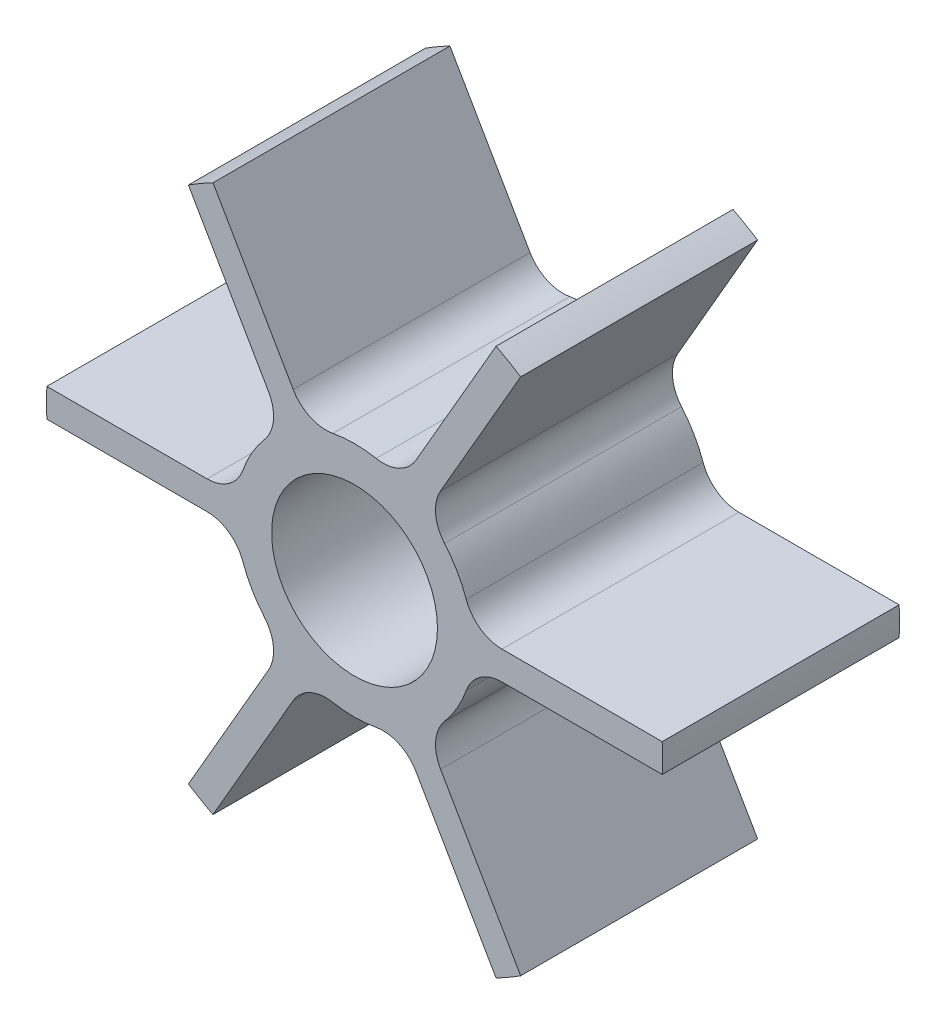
ISO-10303-21;
HEADER;
FILE_DESCRIPTION(('STEP AP214'),'2;1');
FILE_NAME('part.step','',(''),(''),'','','');
FILE_SCHEMA(('AUTOMOTIVE_DESIGN { 1 0 10303 214 1 1 1 1 }'));
ENDSEC;
DATA;
#1=APPLICATION_CONTEXT('core data for automotive mechanical design processes');
#2=APPLICATION_PROTOCOL_DEFINITION('international standard','automotive_design',2000,#1);
#3=PRODUCT_CONTEXT('',#1,'mechanical');
#4=PRODUCT('Part','Part','',(#3));
#5=PRODUCT_RELATED_PRODUCT_CATEGORY('part','',(#4));
#6=PRODUCT_DEFINITION_FORMATION('','',#4);
#7=PRODUCT_DEFINITION_CONTEXT('part definition',#1,'design');
#8=PRODUCT_DEFINITION('design','',#6,#7);
#9=PRODUCT_DEFINITION_SHAPE('','',#8);
#10=(LENGTH_UNIT() NAMED_UNIT(*) SI_UNIT(.MILLI.,.METRE.));
#11=(NAMED_UNIT(*) PLANE_ANGLE_UNIT() SI_UNIT($,.RADIAN.));
#12=(NAMED_UNIT(*) SI_UNIT($,.STERADIAN.) SOLID_ANGLE_UNIT());
#13=UNCERTAINTY_MEASURE_WITH_UNIT(LENGTH_MEASURE(1.E-05),#10,'distance_accuracy_value','');
#14=(GEOMETRIC_REPRESENTATION_CONTEXT(3) GLOBAL_UNCERTAINTY_ASSIGNED_CONTEXT((#13)) GLOBAL_UNIT_ASSIGNED_CONTEXT((#10,
#11,#12)) REPRESENTATION_CONTEXT('',''));
#15=CARTESIAN_POINT('',(0.,0.,0.));
#16=DIRECTION('',(0.,0.,1.));
#17=DIRECTION('',(1.,0.,0.));
#18=AXIS2_PLACEMENT_3D('',#15,#16,#17);
#19=CARTESIAN_POINT('',(0.,0.,50.));
#20=DIRECTION('',(0.,0.,-1.));
#21=DIRECTION('',(-1.,0.,0.));
#22=AXIS2_PLACEMENT_3D('',#19,#20,#21);
#23=CYLINDRICAL_SURFACE('',#22,25.);
#24=CARTESIAN_POINT('',(0.,0.,0.));
#25=DIRECTION('',(0.,0.,1.));
#26=DIRECTION('',(1.,0.,0.));
#27=AXIS2_PLACEMENT_3D('',#24,#25,#26);
#28=CIRCLE('',#27,25.);
#29=CARTESIAN_POINT('',(23.5702260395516,8.33333333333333,0.));
#30=VERTEX_POINT('',#29);
#31=CARTESIAN_POINT('',(19.0019913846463,16.2457478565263,0.));
#32=VERTEX_POINT('',#31);
#33=EDGE_CURVE('E415',#30,#32,#28,.T.);
#34=ORIENTED_EDGE('',*,*,#33,.T.);
#35=DIRECTION('',(0.,0.,-1.));
#36=VECTOR('',#35,1.);
#37=CARTESIAN_POINT('',(19.0019913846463,16.2457478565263,50.));
#38=LINE('',#37,#36);
#39=CARTESIAN_POINT('',(19.0019913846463,16.2457478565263,50.));
#40=VERTEX_POINT('',#39);
#41=EDGE_CURVE('E513',#32,#40,#38,.F.);
#42=ORIENTED_EDGE('',*,*,#41,.T.);
#43=CARTESIAN_POINT('',(0.,0.,50.));
#44=DIRECTION('',(0.,0.,1.));
#45=DIRECTION('',(1.,0.,0.));
#46=AXIS2_PLACEMENT_3D('',#43,#44,#45);
#47=CIRCLE('',#46,25.);
#48=CARTESIAN_POINT('',(23.5702260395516,8.33333333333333,50.));
#49=VERTEX_POINT('',#48);
#50=EDGE_CURVE('E409',#49,#40,#47,.T.);
#51=ORIENTED_EDGE('',*,*,#50,.F.);
#52=DIRECTION('',(0.,0.,-1.));
#53=VECTOR('',#52,1.);
#54=CARTESIAN_POINT('',(23.5702260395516,8.33333333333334,50.));
#55=LINE('',#54,#53);
#56=EDGE_CURVE('E412',#49,#30,#55,.T.);
#57=ORIENTED_EDGE('',*,*,#56,.T.);
#58=EDGE_LOOP('',(#34,#42,#51,#57));
#59=FACE_BOUND('',#58,.T.);
#60=ADVANCED_FACE('F32',(#59),#23,.T.);
#61=CARTESIAN_POINT('',(4.56823465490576,24.5790811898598,50.));
#62=VERTEX_POINT('',#61);
#63=CARTESIAN_POINT('',(-4.56823465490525,24.5790811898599,50.));
#64=VERTEX_POINT('',#63);
#65=EDGE_CURVE('E413',#62,#64,#47,.T.);
#66=ORIENTED_EDGE('',*,*,#65,.F.);
#67=DIRECTION('',(0.,0.,-1.));
#68=VECTOR('',#67,1.);
#69=CARTESIAN_POINT('',(4.56823465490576,24.5790811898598,50.));
#70=LINE('',#69,#68);
#71=CARTESIAN_POINT('',(4.56823465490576,24.5790811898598,0.));
#72=VERTEX_POINT('',#71);
#73=EDGE_CURVE('E53',#62,#72,#70,.T.);
#74=ORIENTED_EDGE('',*,*,#73,.T.);
#75=CARTESIAN_POINT('',(-4.56823465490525,24.5790811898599,0.));
#76=VERTEX_POINT('',#75);
#77=EDGE_CURVE('E418',#72,#76,#28,.T.);
#78=ORIENTED_EDGE('',*,*,#77,.T.);
#79=DIRECTION('',(0.,0.,-1.));
#80=VECTOR('',#79,1.);
#81=CARTESIAN_POINT('',(-4.56823465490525,24.5790811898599,50.));
#82=LINE('',#81,#80);
#83=EDGE_CURVE('E494',#76,#64,#82,.F.);
#84=ORIENTED_EDGE('',*,*,#83,.T.);
#85=EDGE_LOOP('',(#66,#74,#78,#84));
#86=FACE_BOUND('',#85,.T.);
#87=ADVANCED_FACE('F548',(#86),#23,.T.);
#88=CARTESIAN_POINT('',(-19.001991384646,16.2457478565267,50.));
#89=VERTEX_POINT('',#88);
#90=CARTESIAN_POINT('',(-23.5702260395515,8.3333333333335,50.));
#91=VERTEX_POINT('',#90);
#92=EDGE_CURVE('E957',#89,#91,#47,.T.);
#93=ORIENTED_EDGE('',*,*,#92,.F.);
#94=DIRECTION('',(0.,0.,-1.));
#95=VECTOR('',#94,1.);
#96=CARTESIAN_POINT('',(-19.001991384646,16.2457478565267,50.));
#97=LINE('',#96,#95);
#98=CARTESIAN_POINT('',(-19.001991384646,16.2457478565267,0.));
#99=VERTEX_POINT('',#98);
#100=EDGE_CURVE('E502',#89,#99,#97,.T.);
#101=ORIENTED_EDGE('',*,*,#100,.T.);
#102=CARTESIAN_POINT('',(-23.5702260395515,8.3333333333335,0.));
#103=VERTEX_POINT('',#102);
#104=EDGE_CURVE('E600',#99,#103,#28,.T.);
#105=ORIENTED_EDGE('',*,*,#104,.T.);
#106=DIRECTION('',(0.,0.,-1.));
#107=VECTOR('',#106,1.);
#108=CARTESIAN_POINT('',(-23.5702260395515,8.3333333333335,50.));
#109=LINE('',#108,#107);
#110=EDGE_CURVE('E475',#103,#91,#109,.F.);
#111=ORIENTED_EDGE('',*,*,#110,.T.);
#112=EDGE_LOOP('',(#93,#101,#105,#111));
#113=FACE_BOUND('',#112,.T.);
#114=ADVANCED_FACE('F554',(#113),#23,.T.);
#115=CARTESIAN_POINT('',(-23.5702260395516,-8.33333333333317,50.));
#116=VERTEX_POINT('',#115);
#117=CARTESIAN_POINT('',(-19.0019913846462,-16.2457478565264,50.));
#118=VERTEX_POINT('',#117);
#119=EDGE_CURVE('E962',#116,#118,#47,.T.);
#120=ORIENTED_EDGE('',*,*,#119,.F.);
#121=DIRECTION('',(0.,0.,-1.));
#122=VECTOR('',#121,1.);
#123=CARTESIAN_POINT('',(-23.5702260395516,-8.33333333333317,50.));
#124=LINE('',#123,#122);
#125=CARTESIAN_POINT('',(-23.5702260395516,-8.33333333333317,0.));
#126=VERTEX_POINT('',#125);
#127=EDGE_CURVE('E483',#116,#126,#124,.T.);
#128=ORIENTED_EDGE('',*,*,#127,.T.);
#129=CARTESIAN_POINT('',(-19.0019913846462,-16.2457478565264,0.));
#130=VERTEX_POINT('',#129);
#131=EDGE_CURVE('E599',#126,#130,#28,.T.);
#132=ORIENTED_EDGE('',*,*,#131,.T.);
#133=DIRECTION('',(0.,0.,-1.));
#134=VECTOR('',#133,1.);
#135=CARTESIAN_POINT('',(-19.0019913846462,-16.2457478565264,50.));
#136=LINE('',#135,#134);
#137=EDGE_CURVE('E456',#130,#118,#136,.F.);
#138=ORIENTED_EDGE('',*,*,#137,.T.);
#139=EDGE_LOOP('',(#120,#128,#132,#138));
#140=FACE_BOUND('',#139,.T.);
#141=ADVANCED_FACE('F566',(#140),#23,.T.);
#142=CARTESIAN_POINT('',(-4.56823465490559,-24.5790811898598,50.));
#143=VERTEX_POINT('',#142);
#144=CARTESIAN_POINT('',(4.56823465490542,-24.5790811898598,50.));
#145=VERTEX_POINT('',#144);
#146=EDGE_CURVE('E573',#143,#145,#47,.T.);
#147=ORIENTED_EDGE('',*,*,#146,.F.);
#148=DIRECTION('',(0.,0.,-1.));
#149=VECTOR('',#148,1.);
#150=CARTESIAN_POINT('',(-4.56823465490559,-24.5790811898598,50.));
#151=LINE('',#150,#149);
#152=CARTESIAN_POINT('',(-4.56823465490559,-24.5790811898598,0.));
#153=VERTEX_POINT('',#152);
#154=EDGE_CURVE('E464',#143,#153,#151,.T.);
#155=ORIENTED_EDGE('',*,*,#154,.T.);
#156=CARTESIAN_POINT('',(4.56823465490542,-24.5790811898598,0.));
#157=VERTEX_POINT('',#156);
#158=EDGE_CURVE('E597',#153,#157,#28,.T.);
#159=ORIENTED_EDGE('',*,*,#158,.T.);
#160=DIRECTION('',(0.,0.,-1.));
#161=VECTOR('',#160,1.);
#162=CARTESIAN_POINT('',(4.56823465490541,-24.5790811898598,50.));
#163=LINE('',#162,#161);
#164=EDGE_CURVE('E437',#157,#145,#163,.F.);
#165=ORIENTED_EDGE('',*,*,#164,.T.);
#166=EDGE_LOOP('',(#147,#155,#159,#165));
#167=FACE_BOUND('',#166,.T.);
#168=ADVANCED_FACE('F558',(#167),#23,.T.);
#169=CARTESIAN_POINT('',(19.0019913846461,-16.2457478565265,50.));
#170=VERTEX_POINT('',#169);
#171=CARTESIAN_POINT('',(23.5702260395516,-8.33333333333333,50.));
#172=VERTEX_POINT('',#171);
#173=EDGE_CURVE('E414',#170,#172,#47,.T.);
#174=ORIENTED_EDGE('',*,*,#173,.F.);
#175=DIRECTION('',(0.,0.,-1.));
#176=VECTOR('',#175,1.);
#177=CARTESIAN_POINT('',(19.0019913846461,-16.2457478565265,50.));
#178=LINE('',#177,#176);
#179=CARTESIAN_POINT('',(19.0019913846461,-16.2457478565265,0.));
#180=VERTEX_POINT('',#179);
#181=EDGE_CURVE('E445',#170,#180,#178,.T.);
#182=ORIENTED_EDGE('',*,*,#181,.T.);
#183=CARTESIAN_POINT('',(23.5702260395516,-8.33333333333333,0.));
#184=VERTEX_POINT('',#183);
#185=EDGE_CURVE('E406',#180,#184,#28,.T.);
#186=ORIENTED_EDGE('',*,*,#185,.T.);
#187=DIRECTION('',(0.,0.,-1.));
#188=VECTOR('',#187,1.);
#189=CARTESIAN_POINT('',(23.5702260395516,-8.33333333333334,50.));
#190=LINE('',#189,#188);
#191=EDGE_CURVE('E420',#184,#172,#190,.F.);
#192=ORIENTED_EDGE('',*,*,#191,.T.);
#193=EDGE_LOOP('',(#174,#182,#186,#192));
#194=FACE_BOUND('',#193,.T.);
#195=ADVANCED_FACE('F550',(#194),#23,.T.);
#196=CARTESIAN_POINT('',(0.,0.,50.));
#197=DIRECTION('',(0.,0.,1.));
#198=DIRECTION('',(1.,0.,0.));
#199=AXIS2_PLACEMENT_3D('',#196,#197,#198);
#200=PLANE('',#199);
#201=CARTESIAN_POINT('',(0.,0.,50.));
#202=DIRECTION('',(0.,0.,1.));
#203=DIRECTION('',(1.,0.,0.));
#204=AXIS2_PLACEMENT_3D('',#201,#202,#203);
#205=CIRCLE('',#204,17.5);
#206=CARTESIAN_POINT('',(17.5,0.,50.));
#207=VERTEX_POINT('',#206);
#208=EDGE_CURVE('E401',#207,#207,#205,.T.);
#209=ORIENTED_EDGE('',*,*,#208,.F.);
#210=EDGE_LOOP('',(#209));
#211=FACE_BOUND('',#210,.T.);
#212=DIRECTION('',(-1.,0.,0.));
#213=VECTOR('',#212,1.);
#214=CARTESIAN_POINT('',(24.8193472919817,3.,50.));
#215=LINE('',#214,#213);
#216=CARTESIAN_POINT('',(64.9307323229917,3.,50.));
#217=VERTEX_POINT('',#216);
#218=CARTESIAN_POINT('',(31.1126983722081,3.,50.));
#219=VERTEX_POINT('',#218);
#220=EDGE_CURVE('E394',#217,#219,#215,.T.);
#221=ORIENTED_EDGE('',*,*,#220,.T.);
#222=CARTESIAN_POINT('',(31.1126983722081,11.,50.));
#223=DIRECTION('',(0.,0.,1.));
#224=DIRECTION('',(1.,0.,0.));
#225=AXIS2_PLACEMENT_3D('',#222,#223,#224);
#226=CIRCLE('',#225,8.);
#227=EDGE_CURVE('E433',#219,#49,#226,.F.);
#228=ORIENTED_EDGE('',*,*,#227,.T.);
#229=ORIENTED_EDGE('',*,*,#50,.T.);
#230=CARTESIAN_POINT('',(25.0826286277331,21.4443871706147,50.));
#231=DIRECTION('',(0.,0.,1.));
#232=DIRECTION('',(1.,0.,0.));
#233=AXIS2_PLACEMENT_3D('',#230,#231,#232);
#234=CIRCLE('',#233,8.);
#235=CARTESIAN_POINT('',(18.1544253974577,25.4443871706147,50.));
#236=VERTEX_POINT('',#235);
#237=EDGE_CURVE('E521',#40,#236,#234,.F.);
#238=ORIENTED_EDGE('',*,*,#237,.T.);
#239=DIRECTION('',(0.50000000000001,0.866025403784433,0.));
#240=VECTOR('',#239,1.);
#241=CARTESIAN_POINT('',(35.0634423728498,54.7316636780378,50.));
#242=LINE('',#241,#240);
#243=CARTESIAN_POINT('',(35.0634423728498,54.7316636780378,50.));
#244=VERTEX_POINT('',#243);
#245=EDGE_CURVE('E288',#236,#244,#242,.T.);
#246=ORIENTED_EDGE('',*,*,#245,.T.);
#247=CARTESIAN_POINT('',(0.,0.,50.));
#248=DIRECTION('',(0.,0.,1.));
#249=DIRECTION('',(0.50000000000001,0.866025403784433,0.));
#250=AXIS2_PLACEMENT_3D('',#247,#248,#249);
#251=CIRCLE('',#250,65.);
#252=CARTESIAN_POINT('',(29.8672899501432,57.7316636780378,50.));
#253=VERTEX_POINT('',#252);
#254=EDGE_CURVE('E293',#244,#253,#251,.T.);
#255=ORIENTED_EDGE('',*,*,#254,.T.);
#256=DIRECTION('',(-0.50000000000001,-0.866025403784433,0.));
#257=VECTOR('',#256,1.);
#258=CARTESIAN_POINT('',(9.81159743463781,22.9941852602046,50.));
#259=LINE('',#258,#257);
#260=CARTESIAN_POINT('',(12.9582729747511,28.4443871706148,50.));
#261=VERTEX_POINT('',#260);
#262=EDGE_CURVE('E269',#253,#261,#259,.T.);
#263=ORIENTED_EDGE('',*,*,#262,.T.);
#264=CARTESIAN_POINT('',(6.0300697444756,32.4443871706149,50.));
#265=DIRECTION('',(0.,0.,1.));
#266=DIRECTION('',(1.,0.,0.));
#267=AXIS2_PLACEMENT_3D('',#264,#265,#266);
#268=CIRCLE('',#267,8.);
#269=EDGE_CURVE('E40',#261,#62,#268,.F.);
#270=ORIENTED_EDGE('',*,*,#269,.T.);
#271=ORIENTED_EDGE('',*,*,#65,.T.);
#272=CARTESIAN_POINT('',(-6.03006974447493,32.444387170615,50.));
#273=DIRECTION('',(0.,0.,1.));
#274=DIRECTION('',(1.,0.,0.));
#275=AXIS2_PLACEMENT_3D('',#272,#273,#274);
#276=CIRCLE('',#275,8.);
#277=CARTESIAN_POINT('',(-12.9582729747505,28.4443871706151,50.));
#278=VERTEX_POINT('',#277);
#279=EDGE_CURVE('E504',#64,#278,#276,.F.);
#280=ORIENTED_EDGE('',*,*,#279,.T.);
#281=DIRECTION('',(-0.499999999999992,0.866025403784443,0.));
#282=VECTOR('',#281,1.);
#283=CARTESIAN_POINT('',(-29.867289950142,57.7316636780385,50.));
#284=LINE('',#283,#282);
#285=CARTESIAN_POINT('',(-29.867289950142,57.7316636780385,50.));
#286=VERTEX_POINT('',#285);
#287=EDGE_CURVE('E302',#278,#286,#284,.T.);
#288=ORIENTED_EDGE('',*,*,#287,.T.);
#289=CARTESIAN_POINT('',(0.,0.,50.));
#290=DIRECTION('',(0.,0.,1.));
#291=DIRECTION('',(-0.499999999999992,0.866025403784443,0.));
#292=AXIS2_PLACEMENT_3D('',#289,#290,#291);
#293=CIRCLE('',#292,65.);
#294=CARTESIAN_POINT('',(-35.0634423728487,54.7316636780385,50.));
#295=VERTEX_POINT('',#294);
#296=EDGE_CURVE('E296',#286,#295,#293,.T.);
#297=ORIENTED_EDGE('',*,*,#296,.T.);
#298=DIRECTION('',(0.499999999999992,-0.866025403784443,0.));
#299=VECTOR('',#298,1.);
#300=CARTESIAN_POINT('',(-15.007749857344,19.9941852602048,50.));
#301=LINE('',#300,#299);
#302=CARTESIAN_POINT('',(-18.1544253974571,25.4443871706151,50.));
#303=VERTEX_POINT('',#302);
#304=EDGE_CURVE('E310',#295,#303,#301,.T.);
#305=ORIENTED_EDGE('',*,*,#304,.T.);
#306=CARTESIAN_POINT('',(-25.0826286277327,21.4443871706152,50.));
#307=DIRECTION('',(0.,0.,1.));
#308=DIRECTION('',(1.,0.,0.));
#309=AXIS2_PLACEMENT_3D('',#306,#307,#308);
#310=CIRCLE('',#309,8.);
#311=EDGE_CURVE('E509',#303,#89,#310,.F.);
#312=ORIENTED_EDGE('',*,*,#311,.T.);
#313=ORIENTED_EDGE('',*,*,#92,.T.);
#314=CARTESIAN_POINT('',(-31.112698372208,11.0000000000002,50.));
#315=DIRECTION('',(0.,0.,1.));
#316=DIRECTION('',(1.,0.,0.));
#317=AXIS2_PLACEMENT_3D('',#314,#315,#316);
#318=CIRCLE('',#317,8.);
#319=CARTESIAN_POINT('',(-31.1126983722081,3.00000000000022,50.));
#320=VERTEX_POINT('',#319);
#321=EDGE_CURVE('E485',#91,#320,#318,.F.);
#322=ORIENTED_EDGE('',*,*,#321,.T.);
#323=DIRECTION('',(-1.,0.,0.));
#324=VECTOR('',#323,1.);
#325=CARTESIAN_POINT('',(-64.9307323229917,3.00000000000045,50.));
#326=LINE('',#325,#324);
#327=CARTESIAN_POINT('',(-64.9307323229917,3.00000000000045,50.));
#328=VERTEX_POINT('',#327);
#329=EDGE_CURVE('E323',#320,#328,#326,.T.);
#330=ORIENTED_EDGE('',*,*,#329,.T.);
#331=CARTESIAN_POINT('',(0.,0.,50.));
#332=DIRECTION('',(0.,0.,1.));
#333=DIRECTION('',(-1.,0.,0.));
#334=AXIS2_PLACEMENT_3D('',#331,#332,#333);
#335=CIRCLE('',#334,65.);
#336=CARTESIAN_POINT('',(-64.9307323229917,-2.99999999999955,50.));
#337=VERTEX_POINT('',#336);
#338=EDGE_CURVE('E317',#328,#337,#335,.T.);
#339=ORIENTED_EDGE('',*,*,#338,.T.);
#340=DIRECTION('',(1.,0.,0.));
#341=VECTOR('',#340,1.);
#342=CARTESIAN_POINT('',(-24.8193472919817,-2.99999999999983,50.));
#343=LINE('',#342,#341);
#344=CARTESIAN_POINT('',(-31.1126983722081,-2.99999999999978,50.));
#345=VERTEX_POINT('',#344);
#346=EDGE_CURVE('E331',#337,#345,#343,.T.);
#347=ORIENTED_EDGE('',*,*,#346,.T.);
#348=CARTESIAN_POINT('',(-31.1126983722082,-10.9999999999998,50.));
#349=DIRECTION('',(0.,0.,1.));
#350=DIRECTION('',(1.,0.,0.));
#351=AXIS2_PLACEMENT_3D('',#348,#349,#350);
#352=CIRCLE('',#351,8.);
#353=EDGE_CURVE('E490',#345,#116,#352,.F.);
#354=ORIENTED_EDGE('',*,*,#353,.T.);
#355=ORIENTED_EDGE('',*,*,#119,.T.);
#356=CARTESIAN_POINT('',(-25.082628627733,-21.4443871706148,50.));
#357=DIRECTION('',(0.,0.,1.));
#358=DIRECTION('',(1.,0.,0.));
#359=AXIS2_PLACEMENT_3D('',#356,#357,#358);
#360=CIRCLE('',#359,8.);
#361=CARTESIAN_POINT('',(-18.1544253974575,-25.4443871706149,50.));
#362=VERTEX_POINT('',#361);
#363=EDGE_CURVE('E466',#118,#362,#360,.F.);
#364=ORIENTED_EDGE('',*,*,#363,.T.);
#365=DIRECTION('',(-0.500000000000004,-0.866025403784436,0.));
#366=VECTOR('',#365,1.);
#367=CARTESIAN_POINT('',(-35.0634423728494,-54.731663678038,50.));
#368=LINE('',#367,#366);
#369=CARTESIAN_POINT('',(-35.0634423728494,-54.731663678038,50.));
#370=VERTEX_POINT('',#369);
#371=EDGE_CURVE('E344',#362,#370,#368,.T.);
#372=ORIENTED_EDGE('',*,*,#371,.T.);
#373=CARTESIAN_POINT('',(0.,0.,50.));
#374=DIRECTION('',(0.,0.,1.));
#375=DIRECTION('',(-0.500000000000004,-0.866025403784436,0.));
#376=AXIS2_PLACEMENT_3D('',#373,#374,#375);
#377=CIRCLE('',#376,65.);
#378=CARTESIAN_POINT('',(-29.8672899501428,-57.7316636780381,50.));
#379=VERTEX_POINT('',#378);
#380=EDGE_CURVE('E338',#370,#379,#377,.T.);
#381=ORIENTED_EDGE('',*,*,#380,.T.);
#382=DIRECTION('',(0.500000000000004,0.866025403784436,0.));
#383=VECTOR('',#382,1.);
#384=CARTESIAN_POINT('',(-9.81159743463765,-22.9941852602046,50.));
#385=LINE('',#384,#383);
#386=CARTESIAN_POINT('',(-12.9582729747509,-28.4443871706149,50.));
#387=VERTEX_POINT('',#386);
#388=EDGE_CURVE('E352',#379,#387,#385,.T.);
#389=ORIENTED_EDGE('',*,*,#388,.T.);
#390=CARTESIAN_POINT('',(-6.03006974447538,-32.4443871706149,50.));
#391=DIRECTION('',(0.,0.,1.));
#392=DIRECTION('',(1.,0.,0.));
#393=AXIS2_PLACEMENT_3D('',#390,#391,#392);
#394=CIRCLE('',#393,8.);
#395=EDGE_CURVE('E471',#387,#143,#394,.F.);
#396=ORIENTED_EDGE('',*,*,#395,.T.);
#397=ORIENTED_EDGE('',*,*,#146,.T.);
#398=CARTESIAN_POINT('',(6.03006974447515,-32.444387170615,50.));
#399=DIRECTION('',(0.,0.,1.));
#400=DIRECTION('',(1.,0.,0.));
#401=AXIS2_PLACEMENT_3D('',#398,#399,#400);
#402=CIRCLE('',#401,8.);
#403=CARTESIAN_POINT('',(12.9582729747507,-28.444387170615,50.));
#404=VERTEX_POINT('',#403);
#405=EDGE_CURVE('E447',#145,#404,#402,.F.);
#406=ORIENTED_EDGE('',*,*,#405,.T.);
#407=DIRECTION('',(0.499999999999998,-0.86602540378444,0.));
#408=VECTOR('',#407,1.);
#409=CARTESIAN_POINT('',(29.8672899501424,-57.7316636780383,50.));
#410=LINE('',#409,#408);
#411=CARTESIAN_POINT('',(29.8672899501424,-57.7316636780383,50.));
#412=VERTEX_POINT('',#411);
#413=EDGE_CURVE('E365',#404,#412,#410,.T.);
#414=ORIENTED_EDGE('',*,*,#413,.T.);
#415=CARTESIAN_POINT('',(0.,0.,50.));
#416=DIRECTION('',(0.,0.,1.));
#417=DIRECTION('',(0.499999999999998,-0.86602540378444,0.));
#418=AXIS2_PLACEMENT_3D('',#415,#416,#417);
#419=CIRCLE('',#418,65.);
#420=CARTESIAN_POINT('',(35.063442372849,-54.7316636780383,50.));
#421=VERTEX_POINT('',#420);
#422=EDGE_CURVE('E359',#412,#421,#419,.T.);
#423=ORIENTED_EDGE('',*,*,#422,.T.);
#424=DIRECTION('',(-0.499999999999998,0.86602540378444,0.));
#425=VECTOR('',#424,1.);
#426=CARTESIAN_POINT('',(15.0077498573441,-19.9941852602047,50.));
#427=LINE('',#426,#425);
#428=CARTESIAN_POINT('',(18.1544253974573,-25.444387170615,50.));
#429=VERTEX_POINT('',#428);
#430=EDGE_CURVE('E373',#421,#429,#427,.T.);
#431=ORIENTED_EDGE('',*,*,#430,.T.);
#432=CARTESIAN_POINT('',(25.0826286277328,-21.444387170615,50.));
#433=DIRECTION('',(0.,0.,1.));
#434=DIRECTION('',(1.,0.,0.));
#435=AXIS2_PLACEMENT_3D('',#432,#433,#434);
#436=CIRCLE('',#435,8.);
#437=EDGE_CURVE('E452',#429,#170,#436,.F.);
#438=ORIENTED_EDGE('',*,*,#437,.T.);
#439=ORIENTED_EDGE('',*,*,#173,.T.);
#440=CARTESIAN_POINT('',(31.1126983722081,-11.,50.));
#441=DIRECTION('',(0.,0.,1.));
#442=DIRECTION('',(1.,0.,0.));
#443=AXIS2_PLACEMENT_3D('',#440,#441,#442);
#444=CIRCLE('',#443,8.);
#445=CARTESIAN_POINT('',(31.1126983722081,-3.,50.));
#446=VERTEX_POINT('',#445);
#447=EDGE_CURVE('E428',#172,#446,#444,.F.);
#448=ORIENTED_EDGE('',*,*,#447,.T.);
#449=DIRECTION('',(1.,0.,0.));
#450=VECTOR('',#449,1.);
#451=CARTESIAN_POINT('',(64.9307323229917,-3.,50.));
#452=LINE('',#451,#450);
#453=CARTESIAN_POINT('',(64.9307323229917,-3.,50.));
#454=VERTEX_POINT('',#453);
#455=EDGE_CURVE('E386',#446,#454,#452,.T.);
#456=ORIENTED_EDGE('',*,*,#455,.T.);
#457=CARTESIAN_POINT('',(0.,0.,50.));
#458=DIRECTION('',(0.,0.,1.));
#459=DIRECTION('',(1.,0.,0.));
#460=AXIS2_PLACEMENT_3D('',#457,#458,#459);
#461=CIRCLE('',#460,65.);
#462=EDGE_CURVE('E380',#454,#217,#461,.T.);
#463=ORIENTED_EDGE('',*,*,#462,.T.);
#464=EDGE_LOOP('',(#221,#228,#229,#238,#246,#255,#263,#270,#271,#280,#288,#297,#305,#312,#313,
#322,#330,#339,#347,#354,#355,#364,#372,#381,#389,#396,#397,#406,#414,#423,#431,#438,#439,#448,
#456,#463));
#465=FACE_BOUND('',#464,.T.);
#466=ADVANCED_FACE('F534',(#211,#465),#200,.T.);
#467=CARTESIAN_POINT('',(0.,0.,0.));
#468=DIRECTION('',(0.,0.,1.));
#469=DIRECTION('',(1.,0.,0.));
#470=AXIS2_PLACEMENT_3D('',#467,#468,#469);
#471=PLANE('',#470);
#472=CARTESIAN_POINT('',(0.,0.,0.));
#473=DIRECTION('',(0.,0.,1.));
#474=DIRECTION('',(1.,0.,0.));
#475=AXIS2_PLACEMENT_3D('',#472,#473,#474);
#476=CIRCLE('',#475,17.5);
#477=CARTESIAN_POINT('',(17.5,0.,0.));
#478=VERTEX_POINT('',#477);
#479=EDGE_CURVE('E403',#478,#478,#476,.T.);
#480=ORIENTED_EDGE('',*,*,#479,.T.);
#481=EDGE_LOOP('',(#480));
#482=FACE_BOUND('',#481,.T.);
#483=ORIENTED_EDGE('',*,*,#33,.F.);
#484=CARTESIAN_POINT('',(31.1126983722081,11.,0.));
#485=DIRECTION('',(0.,0.,1.));
#486=DIRECTION('',(1.,0.,0.));
#487=AXIS2_PLACEMENT_3D('',#484,#485,#486);
#488=CIRCLE('',#487,8.);
#489=CARTESIAN_POINT('',(31.1126983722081,3.,0.));
#490=VERTEX_POINT('',#489);
#491=EDGE_CURVE('E435',#30,#490,#488,.T.);
#492=ORIENTED_EDGE('',*,*,#491,.T.);
#493=DIRECTION('',(-1.,0.,0.));
#494=VECTOR('',#493,1.);
#495=CARTESIAN_POINT('',(24.8193472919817,3.,0.));
#496=LINE('',#495,#494);
#497=CARTESIAN_POINT('',(64.9307323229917,3.,0.));
#498=VERTEX_POINT('',#497);
#499=EDGE_CURVE('E385',#498,#490,#496,.T.);
#500=ORIENTED_EDGE('',*,*,#499,.F.);
#501=CARTESIAN_POINT('',(0.,0.,0.));
#502=DIRECTION('',(0.,0.,1.));
#503=DIRECTION('',(1.,0.,0.));
#504=AXIS2_PLACEMENT_3D('',#501,#502,#503);
#505=CIRCLE('',#504,65.);
#506=CARTESIAN_POINT('',(64.9307323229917,-3.,0.));
#507=VERTEX_POINT('',#506);
#508=EDGE_CURVE('E382',#507,#498,#505,.T.);
#509=ORIENTED_EDGE('',*,*,#508,.F.);
#510=DIRECTION('',(1.,0.,0.));
#511=VECTOR('',#510,1.);
#512=CARTESIAN_POINT('',(64.9307323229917,-3.,0.));
#513=LINE('',#512,#511);
#514=CARTESIAN_POINT('',(31.1126983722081,-3.,0.));
#515=VERTEX_POINT('',#514);
#516=EDGE_CURVE('E389',#515,#507,#513,.T.);
#517=ORIENTED_EDGE('',*,*,#516,.F.);
#518=CARTESIAN_POINT('',(31.1126983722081,-11.,0.));
#519=DIRECTION('',(0.,0.,1.));
#520=DIRECTION('',(1.,0.,0.));
#521=AXIS2_PLACEMENT_3D('',#518,#519,#520);
#522=CIRCLE('',#521,8.);
#523=EDGE_CURVE('E430',#515,#184,#522,.T.);
#524=ORIENTED_EDGE('',*,*,#523,.T.);
#525=ORIENTED_EDGE('',*,*,#185,.F.);
#526=CARTESIAN_POINT('',(25.0826286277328,-21.444387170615,0.));
#527=DIRECTION('',(0.,0.,1.));
#528=DIRECTION('',(1.,0.,0.));
#529=AXIS2_PLACEMENT_3D('',#526,#527,#528);
#530=CIRCLE('',#529,8.);
#531=CARTESIAN_POINT('',(18.1544253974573,-25.444387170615,0.));
#532=VERTEX_POINT('',#531);
#533=EDGE_CURVE('E454',#180,#532,#530,.T.);
#534=ORIENTED_EDGE('',*,*,#533,.T.);
#535=DIRECTION('',(-0.499999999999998,0.86602540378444,0.));
#536=VECTOR('',#535,1.);
#537=CARTESIAN_POINT('',(15.0077498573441,-19.9941852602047,0.));
#538=LINE('',#537,#536);
#539=CARTESIAN_POINT('',(35.063442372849,-54.7316636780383,0.));
#540=VERTEX_POINT('',#539);
#541=EDGE_CURVE('E364',#540,#532,#538,.T.);
#542=ORIENTED_EDGE('',*,*,#541,.F.);
#543=CARTESIAN_POINT('',(0.,0.,0.));
#544=DIRECTION('',(0.,0.,1.));
#545=DIRECTION('',(0.499999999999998,-0.86602540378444,0.));
#546=AXIS2_PLACEMENT_3D('',#543,#544,#545);
#547=CIRCLE('',#546,65.);
#548=CARTESIAN_POINT('',(29.8672899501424,-57.7316636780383,0.));
#549=VERTEX_POINT('',#548);
#550=EDGE_CURVE('E361',#549,#540,#547,.T.);
#551=ORIENTED_EDGE('',*,*,#550,.F.);
#552=DIRECTION('',(0.499999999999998,-0.86602540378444,0.));
#553=VECTOR('',#552,1.);
#554=CARTESIAN_POINT('',(29.8672899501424,-57.7316636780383,0.));
#555=LINE('',#554,#553);
#556=CARTESIAN_POINT('',(12.9582729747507,-28.444387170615,0.));
#557=VERTEX_POINT('',#556);
#558=EDGE_CURVE('E368',#557,#549,#555,.T.);
#559=ORIENTED_EDGE('',*,*,#558,.F.);
#560=CARTESIAN_POINT('',(6.03006974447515,-32.444387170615,0.));
#561=DIRECTION('',(0.,0.,1.));
#562=DIRECTION('',(1.,0.,0.));
#563=AXIS2_PLACEMENT_3D('',#560,#561,#562);
#564=CIRCLE('',#563,8.);
#565=EDGE_CURVE('E449',#557,#157,#564,.T.);
#566=ORIENTED_EDGE('',*,*,#565,.T.);
#567=ORIENTED_EDGE('',*,*,#158,.F.);
#568=CARTESIAN_POINT('',(-6.03006974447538,-32.4443871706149,0.));
#569=DIRECTION('',(0.,0.,1.));
#570=DIRECTION('',(1.,0.,0.));
#571=AXIS2_PLACEMENT_3D('',#568,#569,#570);
#572=CIRCLE('',#571,8.);
#573=CARTESIAN_POINT('',(-12.9582729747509,-28.4443871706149,0.));
#574=VERTEX_POINT('',#573);
#575=EDGE_CURVE('E473',#153,#574,#572,.T.);
#576=ORIENTED_EDGE('',*,*,#575,.T.);
#577=DIRECTION('',(0.500000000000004,0.866025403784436,0.));
#578=VECTOR('',#577,1.);
#579=CARTESIAN_POINT('',(-9.81159743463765,-22.9941852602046,0.));
#580=LINE('',#579,#578);
#581=CARTESIAN_POINT('',(-29.8672899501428,-57.7316636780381,0.));
#582=VERTEX_POINT('',#581);
#583=EDGE_CURVE('E343',#582,#574,#580,.T.);
#584=ORIENTED_EDGE('',*,*,#583,.F.);
#585=CARTESIAN_POINT('',(0.,0.,0.));
#586=DIRECTION('',(0.,0.,1.));
#587=DIRECTION('',(-0.500000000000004,-0.866025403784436,0.));
#588=AXIS2_PLACEMENT_3D('',#585,#586,#587);
#589=CIRCLE('',#588,65.);
#590=CARTESIAN_POINT('',(-35.0634423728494,-54.731663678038,0.));
#591=VERTEX_POINT('',#590);
#592=EDGE_CURVE('E340',#591,#582,#589,.T.);
#593=ORIENTED_EDGE('',*,*,#592,.F.);
#594=DIRECTION('',(-0.500000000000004,-0.866025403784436,0.));
#595=VECTOR('',#594,1.);
#596=CARTESIAN_POINT('',(-35.0634423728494,-54.731663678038,0.));
#597=LINE('',#596,#595);
#598=CARTESIAN_POINT('',(-18.1544253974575,-25.4443871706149,0.));
#599=VERTEX_POINT('',#598);
#600=EDGE_CURVE('E347',#599,#591,#597,.T.);
#601=ORIENTED_EDGE('',*,*,#600,.F.);
#602=CARTESIAN_POINT('',(-25.082628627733,-21.4443871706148,0.));
#603=DIRECTION('',(0.,0.,1.));
#604=DIRECTION('',(1.,0.,0.));
#605=AXIS2_PLACEMENT_3D('',#602,#603,#604);
#606=CIRCLE('',#605,8.);
#607=EDGE_CURVE('E468',#599,#130,#606,.T.);
#608=ORIENTED_EDGE('',*,*,#607,.T.);
#609=ORIENTED_EDGE('',*,*,#131,.F.);
#610=CARTESIAN_POINT('',(-31.1126983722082,-10.9999999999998,0.));
#611=DIRECTION('',(0.,0.,1.));
#612=DIRECTION('',(1.,0.,0.));
#613=AXIS2_PLACEMENT_3D('',#610,#611,#612);
#614=CIRCLE('',#613,8.);
#615=CARTESIAN_POINT('',(-31.1126983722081,-2.99999999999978,0.));
#616=VERTEX_POINT('',#615);
#617=EDGE_CURVE('E492',#126,#616,#614,.T.);
#618=ORIENTED_EDGE('',*,*,#617,.T.);
#619=DIRECTION('',(1.,0.,0.));
#620=VECTOR('',#619,1.);
#621=CARTESIAN_POINT('',(-24.8193472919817,-2.99999999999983,0.));
#622=LINE('',#621,#620);
#623=CARTESIAN_POINT('',(-64.9307323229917,-2.99999999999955,0.));
#624=VERTEX_POINT('',#623);
#625=EDGE_CURVE('E322',#624,#616,#622,.T.);
#626=ORIENTED_EDGE('',*,*,#625,.F.);
#627=CARTESIAN_POINT('',(0.,0.,0.));
#628=DIRECTION('',(0.,0.,1.));
#629=DIRECTION('',(-1.,0.,0.));
#630=AXIS2_PLACEMENT_3D('',#627,#628,#629);
#631=CIRCLE('',#630,65.);
#632=CARTESIAN_POINT('',(-64.9307323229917,3.00000000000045,0.));
#633=VERTEX_POINT('',#632);
#634=EDGE_CURVE('E319',#633,#624,#631,.T.);
#635=ORIENTED_EDGE('',*,*,#634,.F.);
#636=DIRECTION('',(-1.,0.,0.));
#637=VECTOR('',#636,1.);
#638=CARTESIAN_POINT('',(-64.9307323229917,3.00000000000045,0.));
#639=LINE('',#638,#637);
#640=CARTESIAN_POINT('',(-31.1126983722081,3.00000000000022,0.));
#641=VERTEX_POINT('',#640);
#642=EDGE_CURVE('E326',#641,#633,#639,.T.);
#643=ORIENTED_EDGE('',*,*,#642,.F.);
#644=CARTESIAN_POINT('',(-31.112698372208,11.0000000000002,0.));
#645=DIRECTION('',(0.,0.,1.));
#646=DIRECTION('',(1.,0.,0.));
#647=AXIS2_PLACEMENT_3D('',#644,#645,#646);
#648=CIRCLE('',#647,8.);
#649=EDGE_CURVE('E487',#641,#103,#648,.T.);
#650=ORIENTED_EDGE('',*,*,#649,.T.);
#651=ORIENTED_EDGE('',*,*,#104,.F.);
#652=CARTESIAN_POINT('',(-25.0826286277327,21.4443871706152,0.));
#653=DIRECTION('',(0.,0.,1.));
#654=DIRECTION('',(1.,0.,0.));
#655=AXIS2_PLACEMENT_3D('',#652,#653,#654);
#656=CIRCLE('',#655,8.);
#657=CARTESIAN_POINT('',(-18.1544253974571,25.4443871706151,0.));
#658=VERTEX_POINT('',#657);
#659=EDGE_CURVE('E511',#99,#658,#656,.T.);
#660=ORIENTED_EDGE('',*,*,#659,.T.);
#661=DIRECTION('',(0.499999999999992,-0.866025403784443,0.));
#662=VECTOR('',#661,1.);
#663=CARTESIAN_POINT('',(-15.007749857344,19.9941852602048,0.));
#664=LINE('',#663,#662);
#665=CARTESIAN_POINT('',(-35.0634423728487,54.7316636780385,0.));
#666=VERTEX_POINT('',#665);
#667=EDGE_CURVE('E301',#666,#658,#664,.T.);
#668=ORIENTED_EDGE('',*,*,#667,.F.);
#669=CARTESIAN_POINT('',(0.,0.,0.));
#670=DIRECTION('',(0.,0.,1.));
#671=DIRECTION('',(-0.499999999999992,0.866025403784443,0.));
#672=AXIS2_PLACEMENT_3D('',#669,#670,#671);
#673=CIRCLE('',#672,65.);
#674=CARTESIAN_POINT('',(-29.867289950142,57.7316636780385,0.));
#675=VERTEX_POINT('',#674);
#676=EDGE_CURVE('E298',#675,#666,#673,.T.);
#677=ORIENTED_EDGE('',*,*,#676,.F.);
#678=DIRECTION('',(-0.499999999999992,0.866025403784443,0.));
#679=VECTOR('',#678,1.);
#680=CARTESIAN_POINT('',(-29.867289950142,57.7316636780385,0.));
#681=LINE('',#680,#679);
#682=CARTESIAN_POINT('',(-12.9582729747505,28.4443871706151,0.));
#683=VERTEX_POINT('',#682);
#684=EDGE_CURVE('E305',#683,#675,#681,.T.);
#685=ORIENTED_EDGE('',*,*,#684,.F.);
#686=CARTESIAN_POINT('',(-6.03006974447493,32.444387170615,0.));
#687=DIRECTION('',(0.,0.,1.));
#688=DIRECTION('',(1.,0.,0.));
#689=AXIS2_PLACEMENT_3D('',#686,#687,#688);
#690=CIRCLE('',#689,8.);
#691=EDGE_CURVE('E506',#683,#76,#690,.T.);
#692=ORIENTED_EDGE('',*,*,#691,.T.);
#693=ORIENTED_EDGE('',*,*,#77,.F.);
#694=CARTESIAN_POINT('',(6.0300697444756,32.4443871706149,0.));
#695=DIRECTION('',(0.,0.,1.));
#696=DIRECTION('',(1.,0.,0.));
#697=AXIS2_PLACEMENT_3D('',#694,#695,#696);
#698=CIRCLE('',#697,8.);
#699=CARTESIAN_POINT('',(12.9582729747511,28.4443871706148,0.));
#700=VERTEX_POINT('',#699);
#701=EDGE_CURVE('E11',#72,#700,#698,.T.);
#702=ORIENTED_EDGE('',*,*,#701,.T.);
#703=DIRECTION('',(-0.50000000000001,-0.866025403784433,0.));
#704=VECTOR('',#703,1.);
#705=CARTESIAN_POINT('',(9.81159743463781,22.9941852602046,0.));
#706=LINE('',#705,#704);
#707=CARTESIAN_POINT('',(29.8672899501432,57.7316636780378,0.));
#708=VERTEX_POINT('',#707);
#709=EDGE_CURVE('E267',#708,#700,#706,.T.);
#710=ORIENTED_EDGE('',*,*,#709,.F.);
#711=CARTESIAN_POINT('',(0.,0.,0.));
#712=DIRECTION('',(0.,0.,1.));
#713=DIRECTION('',(0.50000000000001,0.866025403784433,0.));
#714=AXIS2_PLACEMENT_3D('',#711,#712,#713);
#715=CIRCLE('',#714,65.);
#716=CARTESIAN_POINT('',(35.0634423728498,54.7316636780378,0.));
#717=VERTEX_POINT('',#716);
#718=EDGE_CURVE('E282',#717,#708,#715,.T.);
#719=ORIENTED_EDGE('',*,*,#718,.F.);
#720=DIRECTION('',(0.50000000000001,0.866025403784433,0.));
#721=VECTOR('',#720,1.);
#722=CARTESIAN_POINT('',(35.0634423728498,54.7316636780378,0.));
#723=LINE('',#722,#721);
#724=CARTESIAN_POINT('',(18.1544253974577,25.4443871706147,0.));
#725=VERTEX_POINT('',#724);
#726=EDGE_CURVE('E275',#725,#717,#723,.T.);
#727=ORIENTED_EDGE('',*,*,#726,.F.);
#728=CARTESIAN_POINT('',(25.0826286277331,21.4443871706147,0.));
#729=DIRECTION('',(0.,0.,1.));
#730=DIRECTION('',(1.,0.,0.));
#731=AXIS2_PLACEMENT_3D('',#728,#729,#730);
#732=CIRCLE('',#731,8.);
#733=EDGE_CURVE('E523',#725,#32,#732,.T.);
#734=ORIENTED_EDGE('',*,*,#733,.T.);
#735=EDGE_LOOP('',(#483,#492,#500,#509,#517,#524,#525,#534,#542,#551,#559,#566,#567,#576,#584,
#593,#601,#608,#609,#618,#626,#635,#643,#650,#651,#660,#668,#677,#685,#692,#693,#702,#710,#719,
#727,#734));
#736=FACE_BOUND('',#735,.T.);
#737=ADVANCED_FACE('F280',(#482,#736),#471,.F.);
#738=CARTESIAN_POINT('',(0.,0.,0.));
#739=DIRECTION('',(0.,0.,1.));
#740=DIRECTION('',(1.,0.,0.));
#741=AXIS2_PLACEMENT_3D('',#738,#739,#740);
#742=CYLINDRICAL_SURFACE('',#741,17.5);
#743=ORIENTED_EDGE('',*,*,#479,.F.);
#744=EDGE_LOOP('',(#743));
#745=FACE_BOUND('',#744,.T.);
#746=ORIENTED_EDGE('',*,*,#208,.T.);
#747=EDGE_LOOP('',(#746));
#748=FACE_BOUND('',#747,.T.);
#749=ADVANCED_FACE('F852',(#745,#748),#742,.F.);
#750=CARTESIAN_POINT('',(0.,0.,0.));
#751=DIRECTION('',(0.,0.,1.));
#752=DIRECTION('',(1.,0.,0.));
#753=AXIS2_PLACEMENT_3D('',#750,#751,#752);
#754=CYLINDRICAL_SURFACE('',#753,65.);
#755=ORIENTED_EDGE('',*,*,#462,.F.);
#756=DIRECTION('',(0.,0.,1.));
#757=VECTOR('',#756,1.);
#758=CARTESIAN_POINT('',(64.9307323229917,-3.,0.));
#759=LINE('',#758,#757);
#760=EDGE_CURVE('E398',#507,#454,#759,.T.);
#761=ORIENTED_EDGE('',*,*,#760,.F.);
#762=ORIENTED_EDGE('',*,*,#508,.T.);
#763=DIRECTION('',(0.,0.,1.));
#764=VECTOR('',#763,1.);
#765=CARTESIAN_POINT('',(64.9307323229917,3.,0.));
#766=LINE('',#765,#764);
#767=EDGE_CURVE('E391',#498,#217,#766,.T.);
#768=ORIENTED_EDGE('',*,*,#767,.T.);
#769=EDGE_LOOP('',(#755,#761,#762,#768));
#770=FACE_BOUND('',#769,.T.);
#771=ADVANCED_FACE('F613',(#770),#754,.T.);
#772=CARTESIAN_POINT('',(64.9307323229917,-3.,0.));
#773=DIRECTION('',(0.,-1.,0.));
#774=DIRECTION('',(0.,0.,-1.));
#775=AXIS2_PLACEMENT_3D('',#772,#773,#774);
#776=PLANE('',#775);
#777=ORIENTED_EDGE('',*,*,#455,.F.);
#778=DIRECTION('',(0.,0.,-1.));
#779=VECTOR('',#778,1.);
#780=CARTESIAN_POINT('',(31.1126983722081,-3.,0.));
#781=LINE('',#780,#779);
#782=EDGE_CURVE('E423',#446,#515,#781,.T.);
#783=ORIENTED_EDGE('',*,*,#782,.T.);
#784=ORIENTED_EDGE('',*,*,#516,.T.);
#785=ORIENTED_EDGE('',*,*,#760,.T.);
#786=EDGE_LOOP('',(#777,#783,#784,#785));
#787=FACE_BOUND('',#786,.T.);
#788=ADVANCED_FACE('F609',(#787),#776,.T.);
#789=CARTESIAN_POINT('',(24.8193472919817,3.,0.));
#790=DIRECTION('',(0.,1.,0.));
#791=DIRECTION('',(0.,0.,1.));
#792=AXIS2_PLACEMENT_3D('',#789,#790,#791);
#793=PLANE('',#792);
#794=ORIENTED_EDGE('',*,*,#499,.T.);
#795=DIRECTION('',(0.,0.,-1.));
#796=VECTOR('',#795,1.);
#797=CARTESIAN_POINT('',(31.1126983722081,3.,0.));
#798=LINE('',#797,#796);
#799=EDGE_CURVE('E425',#490,#219,#798,.F.);
#800=ORIENTED_EDGE('',*,*,#799,.T.);
#801=ORIENTED_EDGE('',*,*,#220,.F.);
#802=ORIENTED_EDGE('',*,*,#767,.F.);
#803=EDGE_LOOP('',(#794,#800,#801,#802));
#804=FACE_BOUND('',#803,.T.);
#805=ADVANCED_FACE('F616',(#804),#793,.T.);
#806=CARTESIAN_POINT('',(31.1126983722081,-11.,50.));
#807=DIRECTION('',(0.,0.,-1.));
#808=DIRECTION('',(-1.,0.,0.));
#809=AXIS2_PLACEMENT_3D('',#806,#807,#808);
#810=CYLINDRICAL_SURFACE('',#809,8.);
#811=ORIENTED_EDGE('',*,*,#523,.F.);
#812=ORIENTED_EDGE('',*,*,#782,.F.);
#813=ORIENTED_EDGE('',*,*,#447,.F.);
#814=ORIENTED_EDGE('',*,*,#191,.F.);
#815=EDGE_LOOP('',(#811,#812,#813,#814));
#816=FACE_BOUND('',#815,.T.);
#817=ADVANCED_FACE('F606',(#816),#810,.F.);
#818=CARTESIAN_POINT('',(31.1126983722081,11.,50.));
#819=DIRECTION('',(0.,0.,-1.));
#820=DIRECTION('',(-1.,0.,0.));
#821=AXIS2_PLACEMENT_3D('',#818,#819,#820);
#822=CYLINDRICAL_SURFACE('',#821,8.);
#823=ORIENTED_EDGE('',*,*,#491,.F.);
#824=ORIENTED_EDGE('',*,*,#56,.F.);
#825=ORIENTED_EDGE('',*,*,#227,.F.);
#826=ORIENTED_EDGE('',*,*,#799,.F.);
#827=EDGE_LOOP('',(#823,#824,#825,#826));
#828=FACE_BOUND('',#827,.T.);
#829=ADVANCED_FACE('F620',(#828),#822,.F.);
#830=CARTESIAN_POINT('',(0.,0.,0.));
#831=DIRECTION('',(0.,0.,1.));
#832=DIRECTION('',(1.,0.,0.));
#833=AXIS2_PLACEMENT_3D('',#830,#831,#832);
#834=CYLINDRICAL_SURFACE('',#833,65.);
#835=ORIENTED_EDGE('',*,*,#422,.F.);
#836=DIRECTION('',(0.,0.,1.));
#837=VECTOR('',#836,1.);
#838=CARTESIAN_POINT('',(29.8672899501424,-57.7316636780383,0.));
#839=LINE('',#838,#837);
#840=EDGE_CURVE('E377',#549,#412,#839,.T.);
#841=ORIENTED_EDGE('',*,*,#840,.F.);
#842=ORIENTED_EDGE('',*,*,#550,.T.);
#843=DIRECTION('',(0.,0.,1.));
#844=VECTOR('',#843,1.);
#845=CARTESIAN_POINT('',(35.063442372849,-54.7316636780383,0.));
#846=LINE('',#845,#844);
#847=EDGE_CURVE('E370',#540,#421,#846,.T.);
#848=ORIENTED_EDGE('',*,*,#847,.T.);
#849=EDGE_LOOP('',(#835,#841,#842,#848));
#850=FACE_BOUND('',#849,.T.);
#851=ADVANCED_FACE('F585',(#850),#834,.T.);
#852=CARTESIAN_POINT('',(29.8672899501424,-57.7316636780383,0.));
#853=DIRECTION('',(-0.86602540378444,-0.499999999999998,0.));
#854=DIRECTION('',(0.499999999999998,-0.86602540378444,0.));
#855=AXIS2_PLACEMENT_3D('',#852,#853,#854);
#856=PLANE('',#855);
#857=ORIENTED_EDGE('',*,*,#413,.F.);
#858=DIRECTION('',(0.,0.,-1.));
#859=VECTOR('',#858,1.);
#860=CARTESIAN_POINT('',(12.9582729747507,-28.444387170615,0.));
#861=LINE('',#860,#859);
#862=EDGE_CURVE('E440',#404,#557,#861,.T.);
#863=ORIENTED_EDGE('',*,*,#862,.T.);
#864=ORIENTED_EDGE('',*,*,#558,.T.);
#865=ORIENTED_EDGE('',*,*,#840,.T.);
#866=EDGE_LOOP('',(#857,#863,#864,#865));
#867=FACE_BOUND('',#866,.T.);
#868=ADVANCED_FACE('F627',(#867),#856,.T.);
#869=CARTESIAN_POINT('',(15.0077498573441,-19.9941852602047,0.));
#870=DIRECTION('',(0.86602540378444,0.499999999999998,0.));
#871=DIRECTION('',(-0.499999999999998,0.86602540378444,0.));
#872=AXIS2_PLACEMENT_3D('',#869,#870,#871);
#873=PLANE('',#872);
#874=ORIENTED_EDGE('',*,*,#541,.T.);
#875=DIRECTION('',(0.,0.,-1.));
#876=VECTOR('',#875,1.);
#877=CARTESIAN_POINT('',(18.1544253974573,-25.444387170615,0.));
#878=LINE('',#877,#876);
#879=EDGE_CURVE('E442',#532,#429,#878,.F.);
#880=ORIENTED_EDGE('',*,*,#879,.T.);
#881=ORIENTED_EDGE('',*,*,#430,.F.);
#882=ORIENTED_EDGE('',*,*,#847,.F.);
#883=EDGE_LOOP('',(#874,#880,#881,#882));
#884=FACE_BOUND('',#883,.T.);
#885=ADVANCED_FACE('F581',(#884),#873,.T.);
#886=CARTESIAN_POINT('',(0.,0.,0.));
#887=DIRECTION('',(0.,0.,1.));
#888=DIRECTION('',(1.,0.,0.));
#889=AXIS2_PLACEMENT_3D('',#886,#887,#888);
#890=CYLINDRICAL_SURFACE('',#889,65.);
#891=ORIENTED_EDGE('',*,*,#380,.F.);
#892=DIRECTION('',(0.,0.,1.));
#893=VECTOR('',#892,1.);
#894=CARTESIAN_POINT('',(-35.0634423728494,-54.731663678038,0.));
#895=LINE('',#894,#893);
#896=EDGE_CURVE('E356',#591,#370,#895,.T.);
#897=ORIENTED_EDGE('',*,*,#896,.F.);
#898=ORIENTED_EDGE('',*,*,#592,.T.);
#899=DIRECTION('',(0.,0.,1.));
#900=VECTOR('',#899,1.);
#901=CARTESIAN_POINT('',(-29.8672899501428,-57.7316636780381,0.));
#902=LINE('',#901,#900);
#903=EDGE_CURVE('E349',#582,#379,#902,.T.);
#904=ORIENTED_EDGE('',*,*,#903,.T.);
#905=EDGE_LOOP('',(#891,#897,#898,#904));
#906=FACE_BOUND('',#905,.T.);
#907=ADVANCED_FACE('F811',(#906),#890,.T.);
#908=CARTESIAN_POINT('',(-35.0634423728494,-54.731663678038,0.));
#909=DIRECTION('',(-0.866025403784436,0.500000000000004,0.));
#910=DIRECTION('',(-0.500000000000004,-0.866025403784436,0.));
#911=AXIS2_PLACEMENT_3D('',#908,#909,#910);
#912=PLANE('',#911);
#913=ORIENTED_EDGE('',*,*,#371,.F.);
#914=DIRECTION('',(0.,0.,-1.));
#915=VECTOR('',#914,1.);
#916=CARTESIAN_POINT('',(-18.1544253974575,-25.4443871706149,0.));
#917=LINE('',#916,#915);
#918=EDGE_CURVE('E459',#362,#599,#917,.T.);
#919=ORIENTED_EDGE('',*,*,#918,.T.);
#920=ORIENTED_EDGE('',*,*,#600,.T.);
#921=ORIENTED_EDGE('',*,*,#896,.T.);
#922=EDGE_LOOP('',(#913,#919,#920,#921));
#923=FACE_BOUND('',#922,.T.);
#924=ADVANCED_FACE('F801',(#923),#912,.T.);
#925=CARTESIAN_POINT('',(-9.81159743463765,-22.9941852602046,0.));
#926=DIRECTION('',(0.866025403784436,-0.500000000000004,0.));
#927=DIRECTION('',(0.500000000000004,0.866025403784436,0.));
#928=AXIS2_PLACEMENT_3D('',#925,#926,#927);
#929=PLANE('',#928);
#930=ORIENTED_EDGE('',*,*,#583,.T.);
#931=DIRECTION('',(0.,0.,-1.));
#932=VECTOR('',#931,1.);
#933=CARTESIAN_POINT('',(-12.9582729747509,-28.4443871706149,0.));
#934=LINE('',#933,#932);
#935=EDGE_CURVE('E461',#574,#387,#934,.F.);
#936=ORIENTED_EDGE('',*,*,#935,.T.);
#937=ORIENTED_EDGE('',*,*,#388,.F.);
#938=ORIENTED_EDGE('',*,*,#903,.F.);
#939=EDGE_LOOP('',(#930,#936,#937,#938));
#940=FACE_BOUND('',#939,.T.);
#941=ADVANCED_FACE('F791',(#940),#929,.T.);
#942=CARTESIAN_POINT('',(0.,0.,0.));
#943=DIRECTION('',(0.,0.,1.));
#944=DIRECTION('',(1.,0.,0.));
#945=AXIS2_PLACEMENT_3D('',#942,#943,#944);
#946=CYLINDRICAL_SURFACE('',#945,65.);
#947=ORIENTED_EDGE('',*,*,#338,.F.);
#948=DIRECTION('',(0.,0.,1.));
#949=VECTOR('',#948,1.);
#950=CARTESIAN_POINT('',(-64.9307323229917,3.00000000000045,0.));
#951=LINE('',#950,#949);
#952=EDGE_CURVE('E335',#633,#328,#951,.T.);
#953=ORIENTED_EDGE('',*,*,#952,.F.);
#954=ORIENTED_EDGE('',*,*,#634,.T.);
#955=DIRECTION('',(0.,0.,1.));
#956=VECTOR('',#955,1.);
#957=CARTESIAN_POINT('',(-64.9307323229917,-2.99999999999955,0.));
#958=LINE('',#957,#956);
#959=EDGE_CURVE('E328',#624,#337,#958,.T.);
#960=ORIENTED_EDGE('',*,*,#959,.T.);
#961=EDGE_LOOP('',(#947,#953,#954,#960));
#962=FACE_BOUND('',#961,.T.);
#963=ADVANCED_FACE('F781',(#962),#946,.T.);
#964=CARTESIAN_POINT('',(-64.9307323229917,3.00000000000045,0.));
#965=DIRECTION('',(0.,1.,0.));
#966=DIRECTION('',(-1.,0.,0.));
#967=AXIS2_PLACEMENT_3D('',#964,#965,#966);
#968=PLANE('',#967);
#969=ORIENTED_EDGE('',*,*,#329,.F.);
#970=DIRECTION('',(0.,0.,-1.));
#971=VECTOR('',#970,1.);
#972=CARTESIAN_POINT('',(-31.1126983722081,3.00000000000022,0.));
#973=LINE('',#972,#971);
#974=EDGE_CURVE('E478',#320,#641,#973,.T.);
#975=ORIENTED_EDGE('',*,*,#974,.T.);
#976=ORIENTED_EDGE('',*,*,#642,.T.);
#977=ORIENTED_EDGE('',*,*,#952,.T.);
#978=EDGE_LOOP('',(#969,#975,#976,#977));
#979=FACE_BOUND('',#978,.T.);
#980=ADVANCED_FACE('F771',(#979),#968,.T.);
#981=CARTESIAN_POINT('',(-24.8193472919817,-2.99999999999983,0.));
#982=DIRECTION('',(0.,-1.,0.));
#983=DIRECTION('',(1.,0.,0.));
#984=AXIS2_PLACEMENT_3D('',#981,#982,#983);
#985=PLANE('',#984);
#986=ORIENTED_EDGE('',*,*,#625,.T.);
#987=DIRECTION('',(0.,0.,-1.));
#988=VECTOR('',#987,1.);
#989=CARTESIAN_POINT('',(-31.1126983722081,-2.99999999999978,0.));
#990=LINE('',#989,#988);
#991=EDGE_CURVE('E480',#616,#345,#990,.F.);
#992=ORIENTED_EDGE('',*,*,#991,.T.);
#993=ORIENTED_EDGE('',*,*,#346,.F.);
#994=ORIENTED_EDGE('',*,*,#959,.F.);
#995=EDGE_LOOP('',(#986,#992,#993,#994));
#996=FACE_BOUND('',#995,.T.);
#997=ADVANCED_FACE('F761',(#996),#985,.T.);
#998=CARTESIAN_POINT('',(0.,0.,0.));
#999=DIRECTION('',(0.,0.,1.));
#1000=DIRECTION('',(1.,0.,0.));
#1001=AXIS2_PLACEMENT_3D('',#998,#999,#1000);
#1002=CYLINDRICAL_SURFACE('',#1001,65.);
#1003=ORIENTED_EDGE('',*,*,#296,.F.);
#1004=DIRECTION('',(0.,0.,1.));
#1005=VECTOR('',#1004,1.);
#1006=CARTESIAN_POINT('',(-29.867289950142,57.7316636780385,0.));
#1007=LINE('',#1006,#1005);
#1008=EDGE_CURVE('E314',#675,#286,#1007,.T.);
#1009=ORIENTED_EDGE('',*,*,#1008,.F.);
#1010=ORIENTED_EDGE('',*,*,#676,.T.);
#1011=DIRECTION('',(0.,0.,1.));
#1012=VECTOR('',#1011,1.);
#1013=CARTESIAN_POINT('',(-35.0634423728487,54.7316636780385,0.));
#1014=LINE('',#1013,#1012);
#1015=EDGE_CURVE('E307',#666,#295,#1014,.T.);
#1016=ORIENTED_EDGE('',*,*,#1015,.T.);
#1017=EDGE_LOOP('',(#1003,#1009,#1010,#1016));
#1018=FACE_BOUND('',#1017,.T.);
#1019=ADVANCED_FACE('F751',(#1018),#1002,.T.);
#1020=CARTESIAN_POINT('',(-29.867289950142,57.7316636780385,0.));
#1021=DIRECTION('',(0.866025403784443,0.499999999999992,0.));
#1022=DIRECTION('',(-0.499999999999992,0.866025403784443,0.));
#1023=AXIS2_PLACEMENT_3D('',#1020,#1021,#1022);
#1024=PLANE('',#1023);
#1025=ORIENTED_EDGE('',*,*,#287,.F.);
#1026=DIRECTION('',(0.,0.,-1.));
#1027=VECTOR('',#1026,1.);
#1028=CARTESIAN_POINT('',(-12.9582729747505,28.4443871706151,0.));
#1029=LINE('',#1028,#1027);
#1030=EDGE_CURVE('E497',#278,#683,#1029,.T.);
#1031=ORIENTED_EDGE('',*,*,#1030,.T.);
#1032=ORIENTED_EDGE('',*,*,#684,.T.);
#1033=ORIENTED_EDGE('',*,*,#1008,.T.);
#1034=EDGE_LOOP('',(#1025,#1031,#1032,#1033));
#1035=FACE_BOUND('',#1034,.T.);
#1036=ADVANCED_FACE('F741',(#1035),#1024,.T.);
#1037=CARTESIAN_POINT('',(-15.007749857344,19.9941852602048,0.));
#1038=DIRECTION('',(-0.866025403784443,-0.499999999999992,0.));
#1039=DIRECTION('',(0.499999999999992,-0.866025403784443,0.));
#1040=AXIS2_PLACEMENT_3D('',#1037,#1038,#1039);
#1041=PLANE('',#1040);
#1042=ORIENTED_EDGE('',*,*,#667,.T.);
#1043=DIRECTION('',(0.,0.,-1.));
#1044=VECTOR('',#1043,1.);
#1045=CARTESIAN_POINT('',(-18.1544253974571,25.4443871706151,0.));
#1046=LINE('',#1045,#1044);
#1047=EDGE_CURVE('E499',#658,#303,#1046,.F.);
#1048=ORIENTED_EDGE('',*,*,#1047,.T.);
#1049=ORIENTED_EDGE('',*,*,#304,.F.);
#1050=ORIENTED_EDGE('',*,*,#1015,.F.);
#1051=EDGE_LOOP('',(#1042,#1048,#1049,#1050));
#1052=FACE_BOUND('',#1051,.T.);
#1053=ADVANCED_FACE('F545',(#1052),#1041,.T.);
#1054=CARTESIAN_POINT('',(0.,0.,0.));
#1055=DIRECTION('',(0.,0.,1.));
#1056=DIRECTION('',(1.,0.,0.));
#1057=AXIS2_PLACEMENT_3D('',#1054,#1055,#1056);
#1058=CYLINDRICAL_SURFACE('',#1057,65.);
#1059=ORIENTED_EDGE('',*,*,#254,.F.);
#1060=DIRECTION('',(0.,0.,1.));
#1061=VECTOR('',#1060,1.);
#1062=CARTESIAN_POINT('',(35.0634423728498,54.7316636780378,0.));
#1063=LINE('',#1062,#1061);
#1064=EDGE_CURVE('E274',#717,#244,#1063,.T.);
#1065=ORIENTED_EDGE('',*,*,#1064,.F.);
#1066=ORIENTED_EDGE('',*,*,#718,.T.);
#1067=DIRECTION('',(0.,0.,1.));
#1068=VECTOR('',#1067,1.);
#1069=CARTESIAN_POINT('',(29.8672899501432,57.7316636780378,0.));
#1070=LINE('',#1069,#1068);
#1071=EDGE_CURVE('E263',#708,#253,#1070,.T.);
#1072=ORIENTED_EDGE('',*,*,#1071,.T.);
#1073=EDGE_LOOP('',(#1059,#1065,#1066,#1072));
#1074=FACE_BOUND('',#1073,.T.);
#1075=ADVANCED_FACE('F286',(#1074),#1058,.T.);
#1076=CARTESIAN_POINT('',(35.0634423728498,54.7316636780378,0.));
#1077=DIRECTION('',(0.866025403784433,-0.50000000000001,0.));
#1078=DIRECTION('',(0.50000000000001,0.866025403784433,0.));
#1079=AXIS2_PLACEMENT_3D('',#1076,#1077,#1078);
#1080=PLANE('',#1079);
#1081=ORIENTED_EDGE('',*,*,#245,.F.);
#1082=DIRECTION('',(0.,0.,-1.));
#1083=VECTOR('',#1082,1.);
#1084=CARTESIAN_POINT('',(18.1544253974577,25.4443871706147,0.));
#1085=LINE('',#1084,#1083);
#1086=EDGE_CURVE('E516',#236,#725,#1085,.T.);
#1087=ORIENTED_EDGE('',*,*,#1086,.T.);
#1088=ORIENTED_EDGE('',*,*,#726,.T.);
#1089=ORIENTED_EDGE('',*,*,#1064,.T.);
#1090=EDGE_LOOP('',(#1081,#1087,#1088,#1089));
#1091=FACE_BOUND('',#1090,.T.);
#1092=ADVANCED_FACE('F536',(#1091),#1080,.T.);
#1093=CARTESIAN_POINT('',(9.81159743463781,22.9941852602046,0.));
#1094=DIRECTION('',(-0.866025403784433,0.50000000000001,0.));
#1095=DIRECTION('',(-0.50000000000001,-0.866025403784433,0.));
#1096=AXIS2_PLACEMENT_3D('',#1093,#1094,#1095);
#1097=PLANE('',#1096);
#1098=ORIENTED_EDGE('',*,*,#709,.T.);
#1099=DIRECTION('',(0.,0.,-1.));
#1100=VECTOR('',#1099,1.);
#1101=CARTESIAN_POINT('',(12.9582729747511,28.4443871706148,0.));
#1102=LINE('',#1101,#1100);
#1103=EDGE_CURVE('E518',#700,#261,#1102,.F.);
#1104=ORIENTED_EDGE('',*,*,#1103,.T.);
#1105=ORIENTED_EDGE('',*,*,#262,.F.);
#1106=ORIENTED_EDGE('',*,*,#1071,.F.);
#1107=EDGE_LOOP('',(#1098,#1104,#1105,#1106));
#1108=FACE_BOUND('',#1107,.T.);
#1109=ADVANCED_FACE('F265',(#1108),#1097,.T.);
#1110=CARTESIAN_POINT('',(6.03006974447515,-32.444387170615,50.));
#1111=DIRECTION('',(0.,0.,-1.));
#1112=DIRECTION('',(-1.,0.,0.));
#1113=AXIS2_PLACEMENT_3D('',#1110,#1111,#1112);
#1114=CYLINDRICAL_SURFACE('',#1113,8.);
#1115=ORIENTED_EDGE('',*,*,#565,.F.);
#1116=ORIENTED_EDGE('',*,*,#862,.F.);
#1117=ORIENTED_EDGE('',*,*,#405,.F.);
#1118=ORIENTED_EDGE('',*,*,#164,.F.);
#1119=EDGE_LOOP('',(#1115,#1116,#1117,#1118));
#1120=FACE_BOUND('',#1119,.T.);
#1121=ADVANCED_FACE('F543',(#1120),#1114,.F.);
#1122=CARTESIAN_POINT('',(25.0826286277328,-21.444387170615,50.));
#1123=DIRECTION('',(0.,0.,-1.));
#1124=DIRECTION('',(-1.,0.,0.));
#1125=AXIS2_PLACEMENT_3D('',#1122,#1123,#1124);
#1126=CYLINDRICAL_SURFACE('',#1125,8.);
#1127=ORIENTED_EDGE('',*,*,#533,.F.);
#1128=ORIENTED_EDGE('',*,*,#181,.F.);
#1129=ORIENTED_EDGE('',*,*,#437,.F.);
#1130=ORIENTED_EDGE('',*,*,#879,.F.);
#1131=EDGE_LOOP('',(#1127,#1128,#1129,#1130));
#1132=FACE_BOUND('',#1131,.T.);
#1133=ADVANCED_FACE('F576',(#1132),#1126,.F.);
#1134=CARTESIAN_POINT('',(-25.082628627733,-21.4443871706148,50.));
#1135=DIRECTION('',(0.,0.,-1.));
#1136=DIRECTION('',(-1.,0.,0.));
#1137=AXIS2_PLACEMENT_3D('',#1134,#1135,#1136);
#1138=CYLINDRICAL_SURFACE('',#1137,8.);
#1139=ORIENTED_EDGE('',*,*,#607,.F.);
#1140=ORIENTED_EDGE('',*,*,#918,.F.);
#1141=ORIENTED_EDGE('',*,*,#363,.F.);
#1142=ORIENTED_EDGE('',*,*,#137,.F.);
#1143=EDGE_LOOP('',(#1139,#1140,#1141,#1142));
#1144=FACE_BOUND('',#1143,.T.);
#1145=ADVANCED_FACE('F634',(#1144),#1138,.F.);
#1146=CARTESIAN_POINT('',(-6.03006974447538,-32.4443871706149,50.));
#1147=DIRECTION('',(0.,0.,-1.));
#1148=DIRECTION('',(-1.,0.,0.));
#1149=AXIS2_PLACEMENT_3D('',#1146,#1147,#1148);
#1150=CYLINDRICAL_SURFACE('',#1149,8.);
#1151=ORIENTED_EDGE('',*,*,#575,.F.);
#1152=ORIENTED_EDGE('',*,*,#154,.F.);
#1153=ORIENTED_EDGE('',*,*,#395,.F.);
#1154=ORIENTED_EDGE('',*,*,#935,.F.);
#1155=EDGE_LOOP('',(#1151,#1152,#1153,#1154));
#1156=FACE_BOUND('',#1155,.T.);
#1157=ADVANCED_FACE('F637',(#1156),#1150,.F.);
#1158=CARTESIAN_POINT('',(-31.112698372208,11.0000000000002,50.));
#1159=DIRECTION('',(0.,0.,-1.));
#1160=DIRECTION('',(-1.,0.,0.));
#1161=AXIS2_PLACEMENT_3D('',#1158,#1159,#1160);
#1162=CYLINDRICAL_SURFACE('',#1161,8.);
#1163=ORIENTED_EDGE('',*,*,#649,.F.);
#1164=ORIENTED_EDGE('',*,*,#974,.F.);
#1165=ORIENTED_EDGE('',*,*,#321,.F.);
#1166=ORIENTED_EDGE('',*,*,#110,.F.);
#1167=EDGE_LOOP('',(#1163,#1164,#1165,#1166));
#1168=FACE_BOUND('',#1167,.T.);
#1169=ADVANCED_FACE('F641',(#1168),#1162,.F.);
#1170=CARTESIAN_POINT('',(-31.1126983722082,-10.9999999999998,50.));
#1171=DIRECTION('',(0.,0.,-1.));
#1172=DIRECTION('',(-1.,0.,0.));
#1173=AXIS2_PLACEMENT_3D('',#1170,#1171,#1172);
#1174=CYLINDRICAL_SURFACE('',#1173,8.);
#1175=ORIENTED_EDGE('',*,*,#617,.F.);
#1176=ORIENTED_EDGE('',*,*,#127,.F.);
#1177=ORIENTED_EDGE('',*,*,#353,.F.);
#1178=ORIENTED_EDGE('',*,*,#991,.F.);
#1179=EDGE_LOOP('',(#1175,#1176,#1177,#1178));
#1180=FACE_BOUND('',#1179,.T.);
#1181=ADVANCED_FACE('F645',(#1180),#1174,.F.);
#1182=CARTESIAN_POINT('',(-6.03006974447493,32.444387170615,50.));
#1183=DIRECTION('',(0.,0.,-1.));
#1184=DIRECTION('',(-1.,0.,0.));
#1185=AXIS2_PLACEMENT_3D('',#1182,#1183,#1184);
#1186=CYLINDRICAL_SURFACE('',#1185,8.);
#1187=ORIENTED_EDGE('',*,*,#691,.F.);
#1188=ORIENTED_EDGE('',*,*,#1030,.F.);
#1189=ORIENTED_EDGE('',*,*,#279,.F.);
#1190=ORIENTED_EDGE('',*,*,#83,.F.);
#1191=EDGE_LOOP('',(#1187,#1188,#1189,#1190));
#1192=FACE_BOUND('',#1191,.T.);
#1193=ADVANCED_FACE('F649',(#1192),#1186,.F.);
#1194=CARTESIAN_POINT('',(-25.0826286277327,21.4443871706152,50.));
#1195=DIRECTION('',(0.,0.,-1.));
#1196=DIRECTION('',(-1.,0.,0.));
#1197=AXIS2_PLACEMENT_3D('',#1194,#1195,#1196);
#1198=CYLINDRICAL_SURFACE('',#1197,8.);
#1199=ORIENTED_EDGE('',*,*,#659,.F.);
#1200=ORIENTED_EDGE('',*,*,#100,.F.);
#1201=ORIENTED_EDGE('',*,*,#311,.F.);
#1202=ORIENTED_EDGE('',*,*,#1047,.F.);
#1203=EDGE_LOOP('',(#1199,#1200,#1201,#1202));
#1204=FACE_BOUND('',#1203,.T.);
#1205=ADVANCED_FACE('F653',(#1204),#1198,.F.);
#1206=CARTESIAN_POINT('',(25.0826286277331,21.4443871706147,50.));
#1207=DIRECTION('',(0.,0.,-1.));
#1208=DIRECTION('',(-1.,0.,0.));
#1209=AXIS2_PLACEMENT_3D('',#1206,#1207,#1208);
#1210=CYLINDRICAL_SURFACE('',#1209,8.);
#1211=ORIENTED_EDGE('',*,*,#733,.F.);
#1212=ORIENTED_EDGE('',*,*,#1086,.F.);
#1213=ORIENTED_EDGE('',*,*,#237,.F.);
#1214=ORIENTED_EDGE('',*,*,#41,.F.);
#1215=EDGE_LOOP('',(#1211,#1212,#1213,#1214));
#1216=FACE_BOUND('',#1215,.T.);
#1217=ADVANCED_FACE('F532',(#1216),#1210,.F.);
#1218=CARTESIAN_POINT('',(6.0300697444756,32.4443871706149,50.));
#1219=DIRECTION('',(0.,0.,-1.));
#1220=DIRECTION('',(-1.,0.,0.));
#1221=AXIS2_PLACEMENT_3D('',#1218,#1219,#1220);
#1222=CYLINDRICAL_SURFACE('',#1221,8.);
#1223=ORIENTED_EDGE('',*,*,#701,.F.);
#1224=ORIENTED_EDGE('',*,*,#73,.F.);
#1225=ORIENTED_EDGE('',*,*,#269,.F.);
#1226=ORIENTED_EDGE('',*,*,#1103,.F.);
#1227=EDGE_LOOP('',(#1223,#1224,#1225,#1226));
#1228=FACE_BOUND('',#1227,.T.);
#1229=ADVANCED_FACE('F34',(#1228),#1222,.F.);
#1230=CLOSED_SHELL('',(#60,#87,#114,#141,#168,#195,#466,#737,#749,#771,#788,#805,#817,#829,#851,
#868,#885,#907,#924,#941,#963,#980,#997,#1019,#1036,#1053,#1075,#1092,#1109,#1121,#1133,#1145,
#1157,#1169,#1181,#1193,#1205,#1217,#1229));
#1231=MANIFOLD_SOLID_BREP('B2',#1230);
#1232=ADVANCED_BREP_SHAPE_REPRESENTATION('',(#18,#1231),#14);
#1233=SHAPE_DEFINITION_REPRESENTATION(#9,#1232);
ENDSEC;
END-ISO-10303-21;
